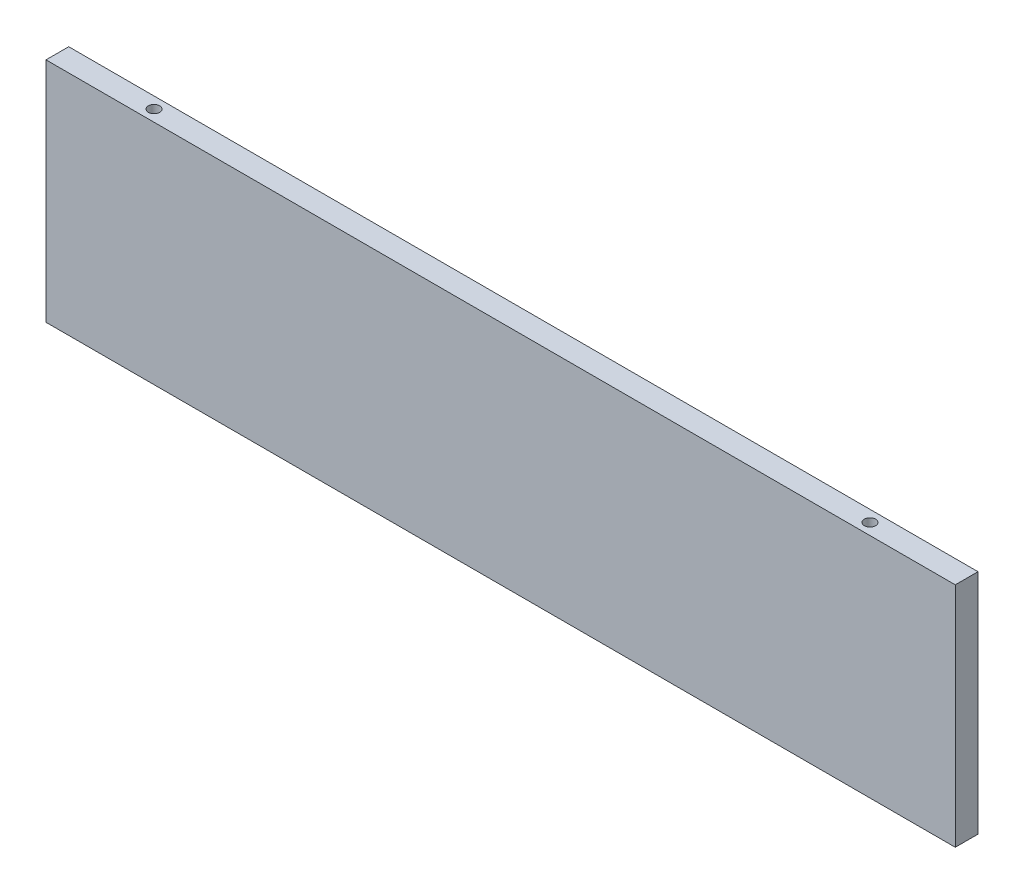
from build123d import *

# Parameters (mm, degrees)
SKETCH1_W          = 508
SKETCH1_H          = 127
EXTRUDE1_DEPTH     = 12.7
SKETCH2_R          = 3.175
CUT_EXTRUDE2_DEPTH = 285.264471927


with BuildPart() as part:
    # Sketch1 → Extrude1 (new body)
    with BuildSketch(Plane.XY):
        Rectangle(SKETCH1_W, SKETCH1_H)
    extrude(amount=EXTRUDE1_DEPTH)

    # Sketch2 → Cut-Extrude2 (cut, through all)
    with BuildSketch(Plane.XZ.offset(63.5)):
        with Locations(Location((200, 6.35, 0), (0, 0, 270))):
            Circle(SKETCH2_R)
    cut_extrude2 = extrude(amount=-CUT_EXTRUDE2_DEPTH, mode=Mode.SUBTRACT)

    # Mirror1: Cut-Extrude2 across plane
    add(cut_extrude2.mirror(Plane(origin=(0, 0, 0), x_dir=(0, 0, 1), z_dir=(1, 0, 0))), mode=Mode.SUBTRACT)


solid = part.part
